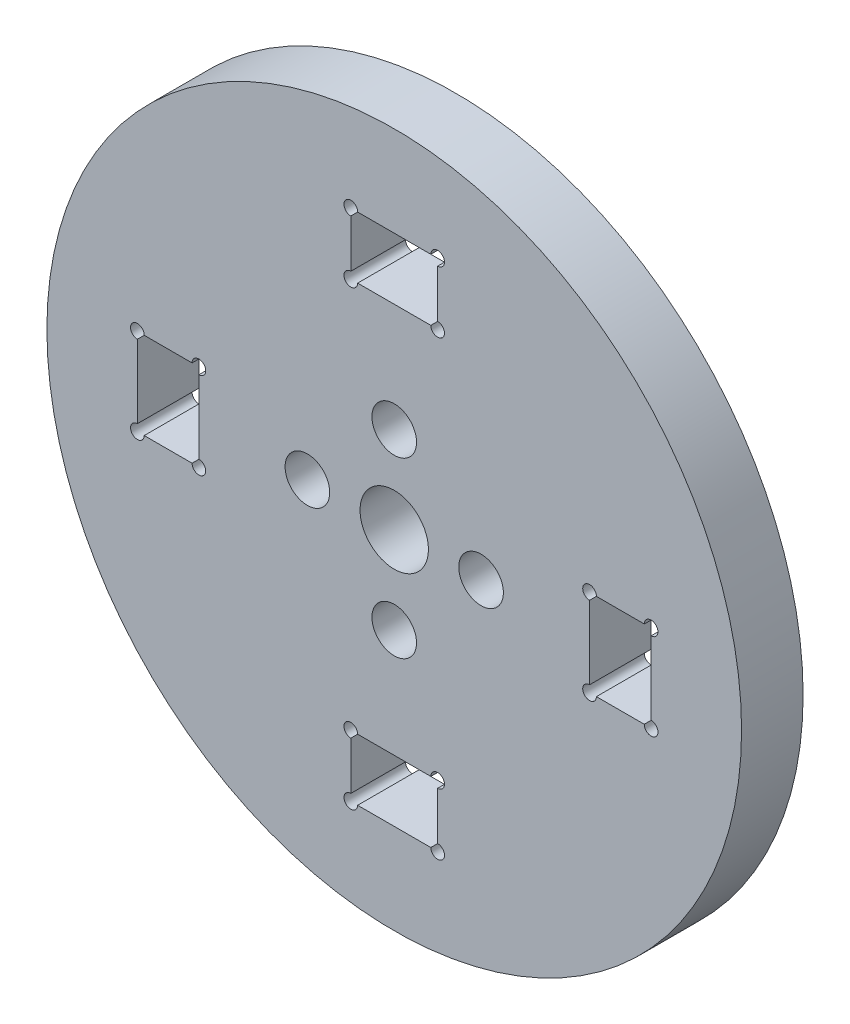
ISO-10303-21;
HEADER;
FILE_DESCRIPTION(('STEP AP214'),'2;1');
FILE_NAME('part.step','',(''),(''),'','','');
FILE_SCHEMA(('AUTOMOTIVE_DESIGN { 1 0 10303 214 1 1 1 1 }'));
ENDSEC;
DATA;
#1=APPLICATION_CONTEXT('core data for automotive mechanical design processes');
#2=APPLICATION_PROTOCOL_DEFINITION('international standard','automotive_design',2000,#1);
#3=PRODUCT_CONTEXT('',#1,'mechanical');
#4=PRODUCT('Part','Part','',(#3));
#5=PRODUCT_RELATED_PRODUCT_CATEGORY('part','',(#4));
#6=PRODUCT_DEFINITION_FORMATION('','',#4);
#7=PRODUCT_DEFINITION_CONTEXT('part definition',#1,'design');
#8=PRODUCT_DEFINITION('design','',#6,#7);
#9=PRODUCT_DEFINITION_SHAPE('','',#8);
#10=(LENGTH_UNIT() NAMED_UNIT(*) SI_UNIT(.MILLI.,.METRE.));
#11=(NAMED_UNIT(*) PLANE_ANGLE_UNIT() SI_UNIT($,.RADIAN.));
#12=(NAMED_UNIT(*) SI_UNIT($,.STERADIAN.) SOLID_ANGLE_UNIT());
#13=UNCERTAINTY_MEASURE_WITH_UNIT(LENGTH_MEASURE(1.E-05),#10,'distance_accuracy_value','');
#14=(GEOMETRIC_REPRESENTATION_CONTEXT(3) GLOBAL_UNCERTAINTY_ASSIGNED_CONTEXT((#13)) GLOBAL_UNIT_ASSIGNED_CONTEXT((#10,
#11,#12)) REPRESENTATION_CONTEXT('',''));
#15=CARTESIAN_POINT('',(0.,0.,0.));
#16=DIRECTION('',(0.,0.,1.));
#17=DIRECTION('',(1.,0.,0.));
#18=AXIS2_PLACEMENT_3D('',#15,#16,#17);
#19=CARTESIAN_POINT('',(0.,0.,4.5));
#20=DIRECTION('',(0.,0.,1.));
#21=DIRECTION('',(1.,0.,0.));
#22=AXIS2_PLACEMENT_3D('',#19,#20,#21);
#23=PLANE('',#22);
#24=CARTESIAN_POINT('',(0.,6.35,4.5));
#25=DIRECTION('',(0.,0.,1.));
#26=DIRECTION('',(1.,0.,0.));
#27=AXIS2_PLACEMENT_3D('',#24,#25,#26);
#28=CIRCLE('',#27,1.63195);
#29=CARTESIAN_POINT('',(1.63195,6.35,4.5));
#30=VERTEX_POINT('',#29);
#31=EDGE_CURVE('E526',#30,#30,#28,.T.);
#32=ORIENTED_EDGE('',*,*,#31,.F.);
#33=EDGE_LOOP('',(#32));
#34=FACE_BOUND('',#33,.T.);
#35=CARTESIAN_POINT('',(6.35000000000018,1.79700204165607E-13,4.5));
#36=DIRECTION('',(0.,0.,1.));
#37=DIRECTION('',(1.,0.,0.));
#38=AXIS2_PLACEMENT_3D('',#35,#36,#37);
#39=CIRCLE('',#38,1.63195);
#40=CARTESIAN_POINT('',(7.98195000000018,1.79700204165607E-13,4.5));
#41=VERTEX_POINT('',#40);
#42=EDGE_CURVE('E517',#41,#41,#39,.T.);
#43=ORIENTED_EDGE('',*,*,#42,.F.);
#44=EDGE_LOOP('',(#43));
#45=FACE_BOUND('',#44,.T.);
#46=CARTESIAN_POINT('',(3.59400408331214E-13,-6.35,4.5));
#47=DIRECTION('',(0.,0.,1.));
#48=DIRECTION('',(1.,0.,0.));
#49=AXIS2_PLACEMENT_3D('',#46,#47,#48);
#50=CIRCLE('',#49,1.63195);
#51=CARTESIAN_POINT('',(1.63195000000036,-6.35,4.5));
#52=VERTEX_POINT('',#51);
#53=EDGE_CURVE('E514',#52,#52,#50,.T.);
#54=ORIENTED_EDGE('',*,*,#53,.F.);
#55=EDGE_LOOP('',(#54));
#56=FACE_BOUND('',#55,.T.);
#57=CARTESIAN_POINT('',(-6.34999999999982,-1.78922553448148E-13,4.5));
#58=DIRECTION('',(0.,0.,1.));
#59=DIRECTION('',(1.,0.,0.));
#60=AXIS2_PLACEMENT_3D('',#57,#58,#59);
#61=CIRCLE('',#60,1.63195);
#62=CARTESIAN_POINT('',(-4.71804999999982,-1.78922553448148E-13,4.5));
#63=VERTEX_POINT('',#62);
#64=EDGE_CURVE('E268',#63,#63,#61,.T.);
#65=ORIENTED_EDGE('',*,*,#64,.F.);
#66=EDGE_LOOP('',(#65));
#67=FACE_BOUND('',#66,.T.);
#68=CARTESIAN_POINT('',(-18.7835533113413,3.17500000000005,4.5));
#69=DIRECTION('',(0.,0.,1.));
#70=DIRECTION('',(1.,0.,0.));
#71=AXIS2_PLACEMENT_3D('',#68,#69,#70);
#72=CIRCLE('',#71,0.5);
#73=CARTESIAN_POINT('',(-18.7835533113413,2.67500000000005,4.5));
#74=VERTEX_POINT('',#73);
#75=CARTESIAN_POINT('',(-18.2835533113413,3.17500000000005,4.5));
#76=VERTEX_POINT('',#75);
#77=EDGE_CURVE('E285',#74,#76,#72,.F.);
#78=ORIENTED_EDGE('',*,*,#77,.T.);
#79=DIRECTION('',(1.,0.,0.));
#80=VECTOR('',#79,1.);
#81=CARTESIAN_POINT('',(0.,3.175,4.5));
#82=LINE('',#81,#80);
#83=CARTESIAN_POINT('',(-14.7835533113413,3.17500000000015,4.5));
#84=VERTEX_POINT('',#83);
#85=EDGE_CURVE('E50',#76,#84,#82,.T.);
#86=ORIENTED_EDGE('',*,*,#85,.T.);
#87=CARTESIAN_POINT('',(-14.2835533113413,3.17500000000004,4.5));
#88=DIRECTION('',(0.,0.,1.));
#89=DIRECTION('',(1.,0.,0.));
#90=AXIS2_PLACEMENT_3D('',#87,#88,#89);
#91=CIRCLE('',#90,0.5);
#92=CARTESIAN_POINT('',(-14.2835533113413,2.67500000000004,4.5));
#93=VERTEX_POINT('',#92);
#94=EDGE_CURVE('E262',#84,#93,#91,.F.);
#95=ORIENTED_EDGE('',*,*,#94,.T.);
#96=DIRECTION('',(0.,1.,0.));
#97=VECTOR('',#96,1.);
#98=CARTESIAN_POINT('',(-14.2835533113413,1.4827788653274E-13,4.5));
#99=LINE('',#98,#97);
#100=CARTESIAN_POINT('',(-14.2835533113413,-2.67499999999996,4.5));
#101=VERTEX_POINT('',#100);
#102=EDGE_CURVE('E265',#101,#93,#99,.T.);
#103=ORIENTED_EDGE('',*,*,#102,.F.);
#104=CARTESIAN_POINT('',(-14.2835533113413,-3.17499999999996,4.5));
#105=DIRECTION('',(0.,0.,1.));
#106=DIRECTION('',(1.,0.,0.));
#107=AXIS2_PLACEMENT_3D('',#104,#105,#106);
#108=CIRCLE('',#107,0.5);
#109=CARTESIAN_POINT('',(-14.7835533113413,-3.17499999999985,4.5));
#110=VERTEX_POINT('',#109);
#111=EDGE_CURVE('E297',#110,#101,#108,.T.);
#112=ORIENTED_EDGE('',*,*,#111,.F.);
#113=DIRECTION('',(1.,0.,0.));
#114=VECTOR('',#113,1.);
#115=CARTESIAN_POINT('',(0.,-3.175,4.5));
#116=LINE('',#115,#114);
#117=CARTESIAN_POINT('',(-18.2835533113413,-3.17499999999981,4.5));
#118=VERTEX_POINT('',#117);
#119=EDGE_CURVE('E294',#118,#110,#116,.T.);
#120=ORIENTED_EDGE('',*,*,#119,.F.);
#121=CARTESIAN_POINT('',(-18.7835533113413,-3.17499999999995,4.5));
#122=DIRECTION('',(0.,0.,1.));
#123=DIRECTION('',(1.,0.,0.));
#124=AXIS2_PLACEMENT_3D('',#121,#122,#123);
#125=CIRCLE('',#124,0.5);
#126=CARTESIAN_POINT('',(-18.7835533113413,-2.67499999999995,4.5));
#127=VERTEX_POINT('',#126);
#128=EDGE_CURVE('E291',#127,#118,#125,.T.);
#129=ORIENTED_EDGE('',*,*,#128,.F.);
#130=DIRECTION('',(0.,1.,0.));
#131=VECTOR('',#130,1.);
#132=CARTESIAN_POINT('',(-18.7835533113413,2.05255249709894E-13,4.5));
#133=LINE('',#132,#131);
#134=EDGE_CURVE('E288',#127,#74,#133,.T.);
#135=ORIENTED_EDGE('',*,*,#134,.T.);
#136=EDGE_LOOP('',(#78,#86,#95,#103,#112,#120,#129,#135));
#137=FACE_BOUND('',#136,.T.);
#138=CARTESIAN_POINT('',(18.7835533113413,-3.17500000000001,4.5));
#139=DIRECTION('',(0.,0.,1.));
#140=DIRECTION('',(1.,0.,0.));
#141=AXIS2_PLACEMENT_3D('',#138,#139,#140);
#142=CIRCLE('',#141,0.5);
#143=CARTESIAN_POINT('',(18.7835533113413,-2.67500000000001,4.5));
#144=VERTEX_POINT('',#143);
#145=CARTESIAN_POINT('',(18.2835533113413,-3.17500000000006,4.5));
#146=VERTEX_POINT('',#145);
#147=EDGE_CURVE('E403',#144,#146,#142,.F.);
#148=ORIENTED_EDGE('',*,*,#147,.T.);
#149=DIRECTION('',(-1.,0.,0.));
#150=VECTOR('',#149,1.);
#151=CARTESIAN_POINT('',(0.,-3.175,4.5));
#152=LINE('',#151,#150);
#153=CARTESIAN_POINT('',(14.7835533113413,-3.17500000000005,4.5));
#154=VERTEX_POINT('',#153);
#155=EDGE_CURVE('E363',#146,#154,#152,.T.);
#156=ORIENTED_EDGE('',*,*,#155,.T.);
#157=CARTESIAN_POINT('',(14.2835533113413,-3.17500000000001,4.5));
#158=DIRECTION('',(0.,0.,1.));
#159=DIRECTION('',(1.,0.,0.));
#160=AXIS2_PLACEMENT_3D('',#157,#158,#159);
#161=CIRCLE('',#160,0.5);
#162=CARTESIAN_POINT('',(14.2835533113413,-2.67500000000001,4.5));
#163=VERTEX_POINT('',#162);
#164=EDGE_CURVE('E381',#154,#163,#161,.F.);
#165=ORIENTED_EDGE('',*,*,#164,.T.);
#166=DIRECTION('',(0.,-1.,0.));
#167=VECTOR('',#166,1.);
#168=CARTESIAN_POINT('',(14.2835533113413,0.,4.5));
#169=LINE('',#168,#167);
#170=CARTESIAN_POINT('',(14.2835533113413,2.67499999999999,4.5));
#171=VERTEX_POINT('',#170);
#172=EDGE_CURVE('E418',#171,#163,#169,.T.);
#173=ORIENTED_EDGE('',*,*,#172,.F.);
#174=CARTESIAN_POINT('',(14.2835533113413,3.17499999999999,4.5));
#175=DIRECTION('',(0.,0.,1.));
#176=DIRECTION('',(1.,0.,0.));
#177=AXIS2_PLACEMENT_3D('',#174,#175,#176);
#178=CIRCLE('',#177,0.5);
#179=CARTESIAN_POINT('',(14.7835533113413,3.17499999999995,4.5));
#180=VERTEX_POINT('',#179);
#181=EDGE_CURVE('E415',#180,#171,#178,.T.);
#182=ORIENTED_EDGE('',*,*,#181,.F.);
#183=DIRECTION('',(-1.,0.,0.));
#184=VECTOR('',#183,1.);
#185=CARTESIAN_POINT('',(0.,3.175,4.5));
#186=LINE('',#185,#184);
#187=CARTESIAN_POINT('',(18.2835533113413,3.17499999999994,4.5));
#188=VERTEX_POINT('',#187);
#189=EDGE_CURVE('E412',#188,#180,#186,.T.);
#190=ORIENTED_EDGE('',*,*,#189,.F.);
#191=CARTESIAN_POINT('',(18.7835533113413,3.17499999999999,4.5));
#192=DIRECTION('',(0.,0.,1.));
#193=DIRECTION('',(1.,0.,0.));
#194=AXIS2_PLACEMENT_3D('',#191,#192,#193);
#195=CIRCLE('',#194,0.5);
#196=CARTESIAN_POINT('',(18.7835533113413,2.67499999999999,4.5));
#197=VERTEX_POINT('',#196);
#198=EDGE_CURVE('E409',#197,#188,#195,.T.);
#199=ORIENTED_EDGE('',*,*,#198,.F.);
#200=DIRECTION('',(0.,-1.,0.));
#201=VECTOR('',#200,1.);
#202=CARTESIAN_POINT('',(18.7835533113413,0.,4.5));
#203=LINE('',#202,#201);
#204=EDGE_CURVE('E406',#197,#144,#203,.T.);
#205=ORIENTED_EDGE('',*,*,#204,.T.);
#206=EDGE_LOOP('',(#148,#156,#165,#173,#182,#190,#199,#205));
#207=FACE_BOUND('',#206,.T.);
#208=CARTESIAN_POINT('',(0.,0.,4.5));
#209=DIRECTION('',(0.,0.,1.));
#210=DIRECTION('',(1.,0.,0.));
#211=AXIS2_PLACEMENT_3D('',#208,#209,#210);
#212=CIRCLE('',#211,25.4);
#213=CARTESIAN_POINT('',(25.4,0.,4.5));
#214=VERTEX_POINT('',#213);
#215=EDGE_CURVE('E11',#214,#214,#212,.T.);
#216=ORIENTED_EDGE('',*,*,#215,.T.);
#217=EDGE_LOOP('',(#216));
#218=FACE_BOUND('',#217,.T.);
#219=CARTESIAN_POINT('',(0.,0.,4.5));
#220=DIRECTION('',(0.,0.,1.));
#221=DIRECTION('',(1.,0.,0.));
#222=AXIS2_PLACEMENT_3D('',#219,#220,#221);
#223=CIRCLE('',#222,2.5);
#224=CARTESIAN_POINT('',(2.5,0.,4.5));
#225=VERTEX_POINT('',#224);
#226=EDGE_CURVE('E503',#225,#225,#223,.T.);
#227=ORIENTED_EDGE('',*,*,#226,.F.);
#228=EDGE_LOOP('',(#227));
#229=FACE_BOUND('',#228,.T.);
#230=DIRECTION('',(1.,0.,0.));
#231=VECTOR('',#230,1.);
#232=CARTESIAN_POINT('',(0.,18.7835533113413,4.5));
#233=LINE('',#232,#231);
#234=CARTESIAN_POINT('',(-2.675,18.7835533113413,4.5));
#235=VERTEX_POINT('',#234);
#236=CARTESIAN_POINT('',(2.675,18.7835533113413,4.5));
#237=VERTEX_POINT('',#236);
#238=EDGE_CURVE('E465',#235,#237,#233,.T.);
#239=ORIENTED_EDGE('',*,*,#238,.T.);
#240=CARTESIAN_POINT('',(3.175,18.7835533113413,4.5));
#241=DIRECTION('',(0.,0.,1.));
#242=DIRECTION('',(1.,0.,0.));
#243=AXIS2_PLACEMENT_3D('',#240,#241,#242);
#244=CIRCLE('',#243,0.5);
#245=CARTESIAN_POINT('',(3.175,18.2835533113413,4.5));
#246=VERTEX_POINT('',#245);
#247=EDGE_CURVE('E426',#237,#246,#244,.F.);
#248=ORIENTED_EDGE('',*,*,#247,.T.);
#249=DIRECTION('',(0.,-1.,0.));
#250=VECTOR('',#249,1.);
#251=CARTESIAN_POINT('',(3.175,0.,4.5));
#252=LINE('',#251,#250);
#253=CARTESIAN_POINT('',(3.175,14.7835533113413,4.5));
#254=VERTEX_POINT('',#253);
#255=EDGE_CURVE('E444',#246,#254,#252,.T.);
#256=ORIENTED_EDGE('',*,*,#255,.T.);
#257=CARTESIAN_POINT('',(3.175,14.2835533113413,4.5));
#258=DIRECTION('',(0.,0.,1.));
#259=DIRECTION('',(1.,0.,0.));
#260=AXIS2_PLACEMENT_3D('',#257,#258,#259);
#261=CIRCLE('',#260,0.5);
#262=CARTESIAN_POINT('',(2.675,14.2835533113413,4.5));
#263=VERTEX_POINT('',#262);
#264=EDGE_CURVE('E480',#254,#263,#261,.F.);
#265=ORIENTED_EDGE('',*,*,#264,.T.);
#266=DIRECTION('',(1.,0.,0.));
#267=VECTOR('',#266,1.);
#268=CARTESIAN_POINT('',(0.,14.2835533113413,4.5));
#269=LINE('',#268,#267);
#270=CARTESIAN_POINT('',(-2.675,14.2835533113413,4.5));
#271=VERTEX_POINT('',#270);
#272=EDGE_CURVE('E477',#271,#263,#269,.T.);
#273=ORIENTED_EDGE('',*,*,#272,.F.);
#274=CARTESIAN_POINT('',(-3.175,14.2835533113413,4.5));
#275=DIRECTION('',(0.,0.,1.));
#276=DIRECTION('',(1.,0.,0.));
#277=AXIS2_PLACEMENT_3D('',#274,#275,#276);
#278=CIRCLE('',#277,0.5);
#279=CARTESIAN_POINT('',(-3.175,14.7835533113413,4.5));
#280=VERTEX_POINT('',#279);
#281=EDGE_CURVE('E474',#280,#271,#278,.T.);
#282=ORIENTED_EDGE('',*,*,#281,.F.);
#283=DIRECTION('',(0.,-1.,0.));
#284=VECTOR('',#283,1.);
#285=CARTESIAN_POINT('',(-3.175,0.,4.5));
#286=LINE('',#285,#284);
#287=CARTESIAN_POINT('',(-3.175,18.2835533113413,4.5));
#288=VERTEX_POINT('',#287);
#289=EDGE_CURVE('E471',#288,#280,#286,.T.);
#290=ORIENTED_EDGE('',*,*,#289,.F.);
#291=CARTESIAN_POINT('',(-3.175,18.7835533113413,4.5));
#292=DIRECTION('',(0.,0.,1.));
#293=DIRECTION('',(1.,0.,0.));
#294=AXIS2_PLACEMENT_3D('',#291,#292,#293);
#295=CIRCLE('',#294,0.5);
#296=EDGE_CURVE('E468',#235,#288,#295,.T.);
#297=ORIENTED_EDGE('',*,*,#296,.F.);
#298=EDGE_LOOP('',(#239,#248,#256,#265,#273,#282,#290,#297));
#299=FACE_BOUND('',#298,.T.);
#300=DIRECTION('',(-1.,0.,0.));
#301=VECTOR('',#300,1.);
#302=CARTESIAN_POINT('',(-1.23153149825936E-13,-18.7835533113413,4.5));
#303=LINE('',#302,#301);
#304=CARTESIAN_POINT('',(2.67499999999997,-18.7835533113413,4.5));
#305=VERTEX_POINT('',#304);
#306=CARTESIAN_POINT('',(-2.67500000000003,-18.7835533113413,4.5));
#307=VERTEX_POINT('',#306);
#308=EDGE_CURVE('E340',#305,#307,#303,.T.);
#309=ORIENTED_EDGE('',*,*,#308,.T.);
#310=CARTESIAN_POINT('',(-3.17500000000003,-18.7835533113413,4.5));
#311=DIRECTION('',(0.,0.,1.));
#312=DIRECTION('',(1.,0.,0.));
#313=AXIS2_PLACEMENT_3D('',#310,#311,#312);
#314=CIRCLE('',#313,0.5);
#315=CARTESIAN_POINT('',(-3.17500000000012,-18.2835533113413,4.5));
#316=VERTEX_POINT('',#315);
#317=EDGE_CURVE('E304',#307,#316,#314,.F.);
#318=ORIENTED_EDGE('',*,*,#317,.T.);
#319=DIRECTION('',(0.,1.,0.));
#320=VECTOR('',#319,1.);
#321=CARTESIAN_POINT('',(-3.175,0.,4.5));
#322=LINE('',#321,#320);
#323=CARTESIAN_POINT('',(-3.1750000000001,-14.7835533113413,4.5));
#324=VERTEX_POINT('',#323);
#325=EDGE_CURVE('E319',#316,#324,#322,.T.);
#326=ORIENTED_EDGE('',*,*,#325,.T.);
#327=CARTESIAN_POINT('',(-3.17500000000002,-14.2835533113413,4.5));
#328=DIRECTION('',(0.,0.,1.));
#329=DIRECTION('',(1.,0.,0.));
#330=AXIS2_PLACEMENT_3D('',#327,#328,#329);
#331=CIRCLE('',#330,0.5);
#332=CARTESIAN_POINT('',(-2.67500000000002,-14.2835533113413,4.5));
#333=VERTEX_POINT('',#332);
#334=EDGE_CURVE('E355',#324,#333,#331,.F.);
#335=ORIENTED_EDGE('',*,*,#334,.T.);
#336=DIRECTION('',(-1.,0.,0.));
#337=VECTOR('',#336,1.);
#338=CARTESIAN_POINT('',(-1.01453290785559E-13,-14.2835533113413,4.5));
#339=LINE('',#338,#337);
#340=CARTESIAN_POINT('',(2.67499999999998,-14.2835533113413,4.5));
#341=VERTEX_POINT('',#340);
#342=EDGE_CURVE('E352',#341,#333,#339,.T.);
#343=ORIENTED_EDGE('',*,*,#342,.F.);
#344=CARTESIAN_POINT('',(3.17499999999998,-14.2835533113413,4.5));
#345=DIRECTION('',(0.,0.,1.));
#346=DIRECTION('',(1.,0.,0.));
#347=AXIS2_PLACEMENT_3D('',#344,#345,#346);
#348=CIRCLE('',#347,0.5);
#349=CARTESIAN_POINT('',(3.1749999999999,-14.7835533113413,4.5));
#350=VERTEX_POINT('',#349);
#351=EDGE_CURVE('E349',#350,#341,#348,.T.);
#352=ORIENTED_EDGE('',*,*,#351,.F.);
#353=DIRECTION('',(0.,1.,0.));
#354=VECTOR('',#353,1.);
#355=CARTESIAN_POINT('',(3.175,0.,4.5));
#356=LINE('',#355,#354);
#357=CARTESIAN_POINT('',(3.17499999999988,-18.2835533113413,4.5));
#358=VERTEX_POINT('',#357);
#359=EDGE_CURVE('E346',#358,#350,#356,.T.);
#360=ORIENTED_EDGE('',*,*,#359,.F.);
#361=CARTESIAN_POINT('',(3.17499999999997,-18.7835533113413,4.5));
#362=DIRECTION('',(0.,0.,1.));
#363=DIRECTION('',(1.,0.,0.));
#364=AXIS2_PLACEMENT_3D('',#361,#362,#363);
#365=CIRCLE('',#364,0.5);
#366=EDGE_CURVE('E343',#305,#358,#365,.T.);
#367=ORIENTED_EDGE('',*,*,#366,.F.);
#368=EDGE_LOOP('',(#309,#318,#326,#335,#343,#352,#360,#367));
#369=FACE_BOUND('',#368,.T.);
#370=ADVANCED_FACE('F33',(#34,#45,#56,#67,#137,#207,#218,#229,#299,#369),#23,.T.);
#371=CARTESIAN_POINT('',(0.,0.,0.));
#372=DIRECTION('',(0.,0.,1.));
#373=DIRECTION('',(1.,0.,0.));
#374=AXIS2_PLACEMENT_3D('',#371,#372,#373);
#375=PLANE('',#374);
#376=CARTESIAN_POINT('',(0.,6.35,0.));
#377=DIRECTION('',(0.,0.,1.));
#378=DIRECTION('',(1.,0.,0.));
#379=AXIS2_PLACEMENT_3D('',#376,#377,#378);
#380=CIRCLE('',#379,1.63195);
#381=CARTESIAN_POINT('',(1.63195,6.35,0.));
#382=VERTEX_POINT('',#381);
#383=EDGE_CURVE('E37',#382,#382,#380,.T.);
#384=ORIENTED_EDGE('',*,*,#383,.T.);
#385=EDGE_LOOP('',(#384));
#386=FACE_BOUND('',#385,.T.);
#387=CARTESIAN_POINT('',(6.35000000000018,1.79700204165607E-13,0.));
#388=DIRECTION('',(0.,0.,1.));
#389=DIRECTION('',(1.,0.,0.));
#390=AXIS2_PLACEMENT_3D('',#387,#388,#389);
#391=CIRCLE('',#390,1.63195);
#392=CARTESIAN_POINT('',(7.98195000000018,1.79700204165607E-13,0.));
#393=VERTEX_POINT('',#392);
#394=EDGE_CURVE('E515',#393,#393,#391,.T.);
#395=ORIENTED_EDGE('',*,*,#394,.T.);
#396=EDGE_LOOP('',(#395));
#397=FACE_BOUND('',#396,.T.);
#398=CARTESIAN_POINT('',(3.59400408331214E-13,-6.35,0.));
#399=DIRECTION('',(0.,0.,1.));
#400=DIRECTION('',(1.,0.,0.));
#401=AXIS2_PLACEMENT_3D('',#398,#399,#400);
#402=CIRCLE('',#401,1.63195);
#403=CARTESIAN_POINT('',(1.63195000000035,-6.35,0.));
#404=VERTEX_POINT('',#403);
#405=EDGE_CURVE('E512',#404,#404,#402,.T.);
#406=ORIENTED_EDGE('',*,*,#405,.T.);
#407=EDGE_LOOP('',(#406));
#408=FACE_BOUND('',#407,.T.);
#409=CARTESIAN_POINT('',(-6.34999999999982,-1.78922553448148E-13,0.));
#410=DIRECTION('',(0.,0.,1.));
#411=DIRECTION('',(1.,0.,0.));
#412=AXIS2_PLACEMENT_3D('',#409,#410,#411);
#413=CIRCLE('',#412,1.63195);
#414=CARTESIAN_POINT('',(-4.71804999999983,-1.78922553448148E-13,0.));
#415=VERTEX_POINT('',#414);
#416=EDGE_CURVE('E286',#415,#415,#413,.T.);
#417=ORIENTED_EDGE('',*,*,#416,.T.);
#418=EDGE_LOOP('',(#417));
#419=FACE_BOUND('',#418,.T.);
#420=DIRECTION('',(1.,0.,0.));
#421=VECTOR('',#420,1.);
#422=CARTESIAN_POINT('',(0.,3.175,0.));
#423=LINE('',#422,#421);
#424=CARTESIAN_POINT('',(-18.2835533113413,3.17500000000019,0.));
#425=VERTEX_POINT('',#424);
#426=CARTESIAN_POINT('',(-14.7835533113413,3.17500000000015,0.));
#427=VERTEX_POINT('',#426);
#428=EDGE_CURVE('E252',#425,#427,#423,.T.);
#429=ORIENTED_EDGE('',*,*,#428,.F.);
#430=CARTESIAN_POINT('',(-18.7835533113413,3.17500000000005,0.));
#431=DIRECTION('',(0.,0.,1.));
#432=DIRECTION('',(1.,0.,0.));
#433=AXIS2_PLACEMENT_3D('',#430,#431,#432);
#434=CIRCLE('',#433,0.5);
#435=CARTESIAN_POINT('',(-18.7835533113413,2.67500000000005,0.));
#436=VERTEX_POINT('',#435);
#437=EDGE_CURVE('E244',#436,#425,#434,.F.);
#438=ORIENTED_EDGE('',*,*,#437,.F.);
#439=DIRECTION('',(0.,1.,0.));
#440=VECTOR('',#439,1.);
#441=CARTESIAN_POINT('',(-18.7835533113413,2.05255249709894E-13,0.));
#442=LINE('',#441,#440);
#443=CARTESIAN_POINT('',(-18.7835533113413,-2.67499999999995,0.));
#444=VERTEX_POINT('',#443);
#445=EDGE_CURVE('E251',#444,#436,#442,.T.);
#446=ORIENTED_EDGE('',*,*,#445,.F.);
#447=CARTESIAN_POINT('',(-18.7835533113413,-3.17499999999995,0.));
#448=DIRECTION('',(0.,0.,1.));
#449=DIRECTION('',(1.,0.,0.));
#450=AXIS2_PLACEMENT_3D('',#447,#448,#449);
#451=CIRCLE('',#450,0.5);
#452=CARTESIAN_POINT('',(-18.2835533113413,-3.17499999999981,0.));
#453=VERTEX_POINT('',#452);
#454=EDGE_CURVE('E272',#444,#453,#451,.T.);
#455=ORIENTED_EDGE('',*,*,#454,.T.);
#456=DIRECTION('',(1.,0.,0.));
#457=VECTOR('',#456,1.);
#458=CARTESIAN_POINT('',(0.,-3.175,0.));
#459=LINE('',#458,#457);
#460=CARTESIAN_POINT('',(-14.7835533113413,-3.17499999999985,0.));
#461=VERTEX_POINT('',#460);
#462=EDGE_CURVE('E275',#453,#461,#459,.T.);
#463=ORIENTED_EDGE('',*,*,#462,.T.);
#464=CARTESIAN_POINT('',(-14.2835533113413,-3.17499999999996,0.));
#465=DIRECTION('',(0.,0.,1.));
#466=DIRECTION('',(1.,0.,0.));
#467=AXIS2_PLACEMENT_3D('',#464,#465,#466);
#468=CIRCLE('',#467,0.5);
#469=CARTESIAN_POINT('',(-14.2835533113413,-2.67499999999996,0.));
#470=VERTEX_POINT('',#469);
#471=EDGE_CURVE('E278',#461,#470,#468,.T.);
#472=ORIENTED_EDGE('',*,*,#471,.T.);
#473=DIRECTION('',(0.,1.,0.));
#474=VECTOR('',#473,1.);
#475=CARTESIAN_POINT('',(-14.2835533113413,1.4827788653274E-13,0.));
#476=LINE('',#475,#474);
#477=CARTESIAN_POINT('',(-14.2835533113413,2.67500000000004,0.));
#478=VERTEX_POINT('',#477);
#479=EDGE_CURVE('E281',#470,#478,#476,.T.);
#480=ORIENTED_EDGE('',*,*,#479,.T.);
#481=CARTESIAN_POINT('',(-14.2835533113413,3.17500000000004,0.));
#482=DIRECTION('',(0.,0.,1.));
#483=DIRECTION('',(1.,0.,0.));
#484=AXIS2_PLACEMENT_3D('',#481,#482,#483);
#485=CIRCLE('',#484,0.5);
#486=EDGE_CURVE('E256',#427,#478,#485,.F.);
#487=ORIENTED_EDGE('',*,*,#486,.F.);
#488=EDGE_LOOP('',(#429,#438,#446,#455,#463,#472,#480,#487));
#489=FACE_BOUND('',#488,.T.);
#490=CARTESIAN_POINT('',(3.175,18.7835533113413,0.));
#491=DIRECTION('',(0.,0.,1.));
#492=DIRECTION('',(1.,0.,0.));
#493=AXIS2_PLACEMENT_3D('',#490,#491,#492);
#494=CIRCLE('',#493,0.5);
#495=CARTESIAN_POINT('',(2.675,18.7835533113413,0.));
#496=VERTEX_POINT('',#495);
#497=CARTESIAN_POINT('',(3.175,18.2835533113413,0.));
#498=VERTEX_POINT('',#497);
#499=EDGE_CURVE('E441',#496,#498,#494,.F.);
#500=ORIENTED_EDGE('',*,*,#499,.F.);
#501=DIRECTION('',(1.,0.,0.));
#502=VECTOR('',#501,1.);
#503=CARTESIAN_POINT('',(0.,18.7835533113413,0.));
#504=LINE('',#503,#502);
#505=CARTESIAN_POINT('',(-2.675,18.7835533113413,0.));
#506=VERTEX_POINT('',#505);
#507=EDGE_CURVE('E443',#506,#496,#504,.T.);
#508=ORIENTED_EDGE('',*,*,#507,.F.);
#509=CARTESIAN_POINT('',(-3.175,18.7835533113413,0.));
#510=DIRECTION('',(0.,0.,1.));
#511=DIRECTION('',(1.,0.,0.));
#512=AXIS2_PLACEMENT_3D('',#509,#510,#511);
#513=CIRCLE('',#512,0.5);
#514=CARTESIAN_POINT('',(-3.175,18.2835533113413,0.));
#515=VERTEX_POINT('',#514);
#516=EDGE_CURVE('E446',#506,#515,#513,.T.);
#517=ORIENTED_EDGE('',*,*,#516,.T.);
#518=DIRECTION('',(0.,-1.,0.));
#519=VECTOR('',#518,1.);
#520=CARTESIAN_POINT('',(-3.175,0.,0.));
#521=LINE('',#520,#519);
#522=CARTESIAN_POINT('',(-3.175,14.7835533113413,0.));
#523=VERTEX_POINT('',#522);
#524=EDGE_CURVE('E449',#515,#523,#521,.T.);
#525=ORIENTED_EDGE('',*,*,#524,.T.);
#526=CARTESIAN_POINT('',(-3.175,14.2835533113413,0.));
#527=DIRECTION('',(0.,0.,1.));
#528=DIRECTION('',(1.,0.,0.));
#529=AXIS2_PLACEMENT_3D('',#526,#527,#528);
#530=CIRCLE('',#529,0.5);
#531=CARTESIAN_POINT('',(-2.675,14.2835533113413,0.));
#532=VERTEX_POINT('',#531);
#533=EDGE_CURVE('E452',#523,#532,#530,.T.);
#534=ORIENTED_EDGE('',*,*,#533,.T.);
#535=DIRECTION('',(1.,0.,0.));
#536=VECTOR('',#535,1.);
#537=CARTESIAN_POINT('',(0.,14.2835533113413,0.));
#538=LINE('',#537,#536);
#539=CARTESIAN_POINT('',(2.675,14.2835533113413,0.));
#540=VERTEX_POINT('',#539);
#541=EDGE_CURVE('E455',#532,#540,#538,.T.);
#542=ORIENTED_EDGE('',*,*,#541,.T.);
#543=CARTESIAN_POINT('',(3.175,14.2835533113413,0.));
#544=DIRECTION('',(0.,0.,1.));
#545=DIRECTION('',(1.,0.,0.));
#546=AXIS2_PLACEMENT_3D('',#543,#544,#545);
#547=CIRCLE('',#546,0.5);
#548=CARTESIAN_POINT('',(3.175,14.7835533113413,0.));
#549=VERTEX_POINT('',#548);
#550=EDGE_CURVE('E458',#549,#540,#547,.F.);
#551=ORIENTED_EDGE('',*,*,#550,.F.);
#552=DIRECTION('',(0.,-1.,0.));
#553=VECTOR('',#552,1.);
#554=CARTESIAN_POINT('',(3.175,0.,0.));
#555=LINE('',#554,#553);
#556=EDGE_CURVE('E460',#498,#549,#555,.T.);
#557=ORIENTED_EDGE('',*,*,#556,.F.);
#558=EDGE_LOOP('',(#500,#508,#517,#525,#534,#542,#551,#557));
#559=FACE_BOUND('',#558,.T.);
#560=CARTESIAN_POINT('',(0.,0.,0.));
#561=DIRECTION('',(0.,0.,1.));
#562=DIRECTION('',(1.,0.,0.));
#563=AXIS2_PLACEMENT_3D('',#560,#561,#562);
#564=CIRCLE('',#563,25.4);
#565=CARTESIAN_POINT('',(25.4,0.,0.));
#566=VERTEX_POINT('',#565);
#567=EDGE_CURVE('E42',#566,#566,#564,.T.);
#568=ORIENTED_EDGE('',*,*,#567,.F.);
#569=EDGE_LOOP('',(#568));
#570=FACE_BOUND('',#569,.T.);
#571=CARTESIAN_POINT('',(0.,0.,0.));
#572=DIRECTION('',(0.,0.,1.));
#573=DIRECTION('',(1.,0.,0.));
#574=AXIS2_PLACEMENT_3D('',#571,#572,#573);
#575=CIRCLE('',#574,2.5);
#576=CARTESIAN_POINT('',(2.5,0.,0.));
#577=VERTEX_POINT('',#576);
#578=EDGE_CURVE('E488',#577,#577,#575,.T.);
#579=ORIENTED_EDGE('',*,*,#578,.T.);
#580=EDGE_LOOP('',(#579));
#581=FACE_BOUND('',#580,.T.);
#582=DIRECTION('',(-1.,0.,0.));
#583=VECTOR('',#582,1.);
#584=CARTESIAN_POINT('',(0.,-3.175,0.));
#585=LINE('',#584,#583);
#586=CARTESIAN_POINT('',(18.2835533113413,-3.17500000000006,0.));
#587=VERTEX_POINT('',#586);
#588=CARTESIAN_POINT('',(14.7835533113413,-3.17500000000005,0.));
#589=VERTEX_POINT('',#588);
#590=EDGE_CURVE('E378',#587,#589,#585,.T.);
#591=ORIENTED_EDGE('',*,*,#590,.F.);
#592=CARTESIAN_POINT('',(18.7835533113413,-3.17500000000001,0.));
#593=DIRECTION('',(0.,0.,1.));
#594=DIRECTION('',(1.,0.,0.));
#595=AXIS2_PLACEMENT_3D('',#592,#593,#594);
#596=CIRCLE('',#595,0.5);
#597=CARTESIAN_POINT('',(18.7835533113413,-2.67500000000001,0.));
#598=VERTEX_POINT('',#597);
#599=EDGE_CURVE('E380',#598,#587,#596,.F.);
#600=ORIENTED_EDGE('',*,*,#599,.F.);
#601=DIRECTION('',(0.,-1.,0.));
#602=VECTOR('',#601,1.);
#603=CARTESIAN_POINT('',(18.7835533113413,0.,0.));
#604=LINE('',#603,#602);
#605=CARTESIAN_POINT('',(18.7835533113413,2.67499999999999,0.));
#606=VERTEX_POINT('',#605);
#607=EDGE_CURVE('E383',#606,#598,#604,.T.);
#608=ORIENTED_EDGE('',*,*,#607,.F.);
#609=CARTESIAN_POINT('',(18.7835533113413,3.17499999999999,0.));
#610=DIRECTION('',(0.,0.,1.));
#611=DIRECTION('',(1.,0.,0.));
#612=AXIS2_PLACEMENT_3D('',#609,#610,#611);
#613=CIRCLE('',#612,0.5);
#614=CARTESIAN_POINT('',(18.2835533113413,3.17499999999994,0.));
#615=VERTEX_POINT('',#614);
#616=EDGE_CURVE('E386',#606,#615,#613,.T.);
#617=ORIENTED_EDGE('',*,*,#616,.T.);
#618=DIRECTION('',(-1.,0.,0.));
#619=VECTOR('',#618,1.);
#620=CARTESIAN_POINT('',(0.,3.175,0.));
#621=LINE('',#620,#619);
#622=CARTESIAN_POINT('',(14.7835533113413,3.17499999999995,0.));
#623=VERTEX_POINT('',#622);
#624=EDGE_CURVE('E389',#615,#623,#621,.T.);
#625=ORIENTED_EDGE('',*,*,#624,.T.);
#626=CARTESIAN_POINT('',(14.2835533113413,3.17499999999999,0.));
#627=DIRECTION('',(0.,0.,1.));
#628=DIRECTION('',(1.,0.,0.));
#629=AXIS2_PLACEMENT_3D('',#626,#627,#628);
#630=CIRCLE('',#629,0.5);
#631=CARTESIAN_POINT('',(14.2835533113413,2.67499999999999,0.));
#632=VERTEX_POINT('',#631);
#633=EDGE_CURVE('E392',#623,#632,#630,.T.);
#634=ORIENTED_EDGE('',*,*,#633,.T.);
#635=DIRECTION('',(0.,-1.,0.));
#636=VECTOR('',#635,1.);
#637=CARTESIAN_POINT('',(14.2835533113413,0.,0.));
#638=LINE('',#637,#636);
#639=CARTESIAN_POINT('',(14.2835533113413,-2.67500000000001,0.));
#640=VERTEX_POINT('',#639);
#641=EDGE_CURVE('E395',#632,#640,#638,.T.);
#642=ORIENTED_EDGE('',*,*,#641,.T.);
#643=CARTESIAN_POINT('',(14.2835533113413,-3.17500000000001,0.));
#644=DIRECTION('',(0.,0.,1.));
#645=DIRECTION('',(1.,0.,0.));
#646=AXIS2_PLACEMENT_3D('',#643,#644,#645);
#647=CIRCLE('',#646,0.5);
#648=EDGE_CURVE('E398',#589,#640,#647,.F.);
#649=ORIENTED_EDGE('',*,*,#648,.F.);
#650=EDGE_LOOP('',(#591,#600,#608,#617,#625,#634,#642,#649));
#651=FACE_BOUND('',#650,.T.);
#652=CARTESIAN_POINT('',(-3.17500000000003,-18.7835533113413,0.));
#653=DIRECTION('',(0.,0.,1.));
#654=DIRECTION('',(1.,0.,0.));
#655=AXIS2_PLACEMENT_3D('',#652,#653,#654);
#656=CIRCLE('',#655,0.5);
#657=CARTESIAN_POINT('',(-2.67500000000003,-18.7835533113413,0.));
#658=VERTEX_POINT('',#657);
#659=CARTESIAN_POINT('',(-3.17500000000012,-18.2835533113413,0.));
#660=VERTEX_POINT('',#659);
#661=EDGE_CURVE('E316',#658,#660,#656,.F.);
#662=ORIENTED_EDGE('',*,*,#661,.F.);
#663=DIRECTION('',(-1.,0.,0.));
#664=VECTOR('',#663,1.);
#665=CARTESIAN_POINT('',(-1.23153149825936E-13,-18.7835533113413,0.));
#666=LINE('',#665,#664);
#667=CARTESIAN_POINT('',(2.67499999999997,-18.7835533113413,0.));
#668=VERTEX_POINT('',#667);
#669=EDGE_CURVE('E318',#668,#658,#666,.T.);
#670=ORIENTED_EDGE('',*,*,#669,.F.);
#671=CARTESIAN_POINT('',(3.17499999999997,-18.7835533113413,0.));
#672=DIRECTION('',(0.,0.,1.));
#673=DIRECTION('',(1.,0.,0.));
#674=AXIS2_PLACEMENT_3D('',#671,#672,#673);
#675=CIRCLE('',#674,0.5);
#676=CARTESIAN_POINT('',(3.17499999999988,-18.2835533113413,0.));
#677=VERTEX_POINT('',#676);
#678=EDGE_CURVE('E321',#668,#677,#675,.T.);
#679=ORIENTED_EDGE('',*,*,#678,.T.);
#680=DIRECTION('',(0.,1.,0.));
#681=VECTOR('',#680,1.);
#682=CARTESIAN_POINT('',(3.175,0.,0.));
#683=LINE('',#682,#681);
#684=CARTESIAN_POINT('',(3.1749999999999,-14.7835533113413,0.));
#685=VERTEX_POINT('',#684);
#686=EDGE_CURVE('E324',#677,#685,#683,.T.);
#687=ORIENTED_EDGE('',*,*,#686,.T.);
#688=CARTESIAN_POINT('',(3.17499999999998,-14.2835533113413,0.));
#689=DIRECTION('',(0.,0.,1.));
#690=DIRECTION('',(1.,0.,0.));
#691=AXIS2_PLACEMENT_3D('',#688,#689,#690);
#692=CIRCLE('',#691,0.5);
#693=CARTESIAN_POINT('',(2.67499999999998,-14.2835533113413,0.));
#694=VERTEX_POINT('',#693);
#695=EDGE_CURVE('E327',#685,#694,#692,.T.);
#696=ORIENTED_EDGE('',*,*,#695,.T.);
#697=DIRECTION('',(-1.,0.,0.));
#698=VECTOR('',#697,1.);
#699=CARTESIAN_POINT('',(-1.01453290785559E-13,-14.2835533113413,0.));
#700=LINE('',#699,#698);
#701=CARTESIAN_POINT('',(-2.67500000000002,-14.2835533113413,0.));
#702=VERTEX_POINT('',#701);
#703=EDGE_CURVE('E330',#694,#702,#700,.T.);
#704=ORIENTED_EDGE('',*,*,#703,.T.);
#705=CARTESIAN_POINT('',(-3.17500000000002,-14.2835533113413,0.));
#706=DIRECTION('',(0.,0.,1.));
#707=DIRECTION('',(1.,0.,0.));
#708=AXIS2_PLACEMENT_3D('',#705,#706,#707);
#709=CIRCLE('',#708,0.5);
#710=CARTESIAN_POINT('',(-3.1750000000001,-14.7835533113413,0.));
#711=VERTEX_POINT('',#710);
#712=EDGE_CURVE('E333',#711,#702,#709,.F.);
#713=ORIENTED_EDGE('',*,*,#712,.F.);
#714=DIRECTION('',(0.,1.,0.));
#715=VECTOR('',#714,1.);
#716=CARTESIAN_POINT('',(-3.175,0.,0.));
#717=LINE('',#716,#715);
#718=EDGE_CURVE('E335',#660,#711,#717,.T.);
#719=ORIENTED_EDGE('',*,*,#718,.F.);
#720=EDGE_LOOP('',(#662,#670,#679,#687,#696,#704,#713,#719));
#721=FACE_BOUND('',#720,.T.);
#722=ADVANCED_FACE('F259',(#386,#397,#408,#419,#489,#559,#570,#581,#651,#721),#375,.F.);
#723=CARTESIAN_POINT('',(0.,0.,4.5));
#724=DIRECTION('',(0.,0.,-1.));
#725=DIRECTION('',(-1.,0.,0.));
#726=AXIS2_PLACEMENT_3D('',#723,#724,#725);
#727=CYLINDRICAL_SURFACE('',#726,25.4);
#728=ORIENTED_EDGE('',*,*,#215,.F.);
#729=EDGE_LOOP('',(#728));
#730=FACE_BOUND('',#729,.T.);
#731=ORIENTED_EDGE('',*,*,#567,.T.);
#732=EDGE_LOOP('',(#731));
#733=FACE_BOUND('',#732,.T.);
#734=ADVANCED_FACE('F35',(#730,#733),#727,.T.);
#735=CARTESIAN_POINT('',(0.,0.,4.5));
#736=DIRECTION('',(0.,0.,-1.));
#737=DIRECTION('',(-1.,0.,0.));
#738=AXIS2_PLACEMENT_3D('',#735,#736,#737);
#739=CYLINDRICAL_SURFACE('',#738,2.5);
#740=ORIENTED_EDGE('',*,*,#226,.T.);
#741=EDGE_LOOP('',(#740));
#742=FACE_BOUND('',#741,.T.);
#743=ORIENTED_EDGE('',*,*,#578,.F.);
#744=EDGE_LOOP('',(#743));
#745=FACE_BOUND('',#744,.T.);
#746=ADVANCED_FACE('F663',(#742,#745),#739,.F.);
#747=CARTESIAN_POINT('',(3.175,18.7835533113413,0.));
#748=DIRECTION('',(0.,0.,1.));
#749=DIRECTION('',(1.,0.,0.));
#750=AXIS2_PLACEMENT_3D('',#747,#748,#749);
#751=CYLINDRICAL_SURFACE('',#750,0.5);
#752=ORIENTED_EDGE('',*,*,#247,.F.);
#753=DIRECTION('',(0.,0.,1.));
#754=VECTOR('',#753,1.);
#755=CARTESIAN_POINT('',(2.675,18.7835533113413,0.));
#756=LINE('',#755,#754);
#757=EDGE_CURVE('E462',#496,#237,#756,.T.);
#758=ORIENTED_EDGE('',*,*,#757,.F.);
#759=ORIENTED_EDGE('',*,*,#499,.T.);
#760=DIRECTION('',(0.,0.,1.));
#761=VECTOR('',#760,1.);
#762=CARTESIAN_POINT('',(3.175,18.2835533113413,0.));
#763=LINE('',#762,#761);
#764=EDGE_CURVE('E485',#498,#246,#763,.T.);
#765=ORIENTED_EDGE('',*,*,#764,.T.);
#766=EDGE_LOOP('',(#752,#758,#759,#765));
#767=FACE_BOUND('',#766,.T.);
#768=ADVANCED_FACE('F637',(#767),#751,.F.);
#769=CARTESIAN_POINT('',(3.175,0.,0.));
#770=DIRECTION('',(-1.,0.,0.));
#771=DIRECTION('',(0.,-1.,0.));
#772=AXIS2_PLACEMENT_3D('',#769,#770,#771);
#773=PLANE('',#772);
#774=ORIENTED_EDGE('',*,*,#255,.F.);
#775=ORIENTED_EDGE('',*,*,#764,.F.);
#776=ORIENTED_EDGE('',*,*,#556,.T.);
#777=DIRECTION('',(0.,0.,1.));
#778=VECTOR('',#777,1.);
#779=CARTESIAN_POINT('',(3.175,14.7835533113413,0.));
#780=LINE('',#779,#778);
#781=EDGE_CURVE('E489',#549,#254,#780,.T.);
#782=ORIENTED_EDGE('',*,*,#781,.T.);
#783=EDGE_LOOP('',(#774,#775,#776,#782));
#784=FACE_BOUND('',#783,.T.);
#785=ADVANCED_FACE('F633',(#784),#773,.T.);
#786=CARTESIAN_POINT('',(3.175,14.2835533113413,0.));
#787=DIRECTION('',(0.,0.,1.));
#788=DIRECTION('',(1.,0.,0.));
#789=AXIS2_PLACEMENT_3D('',#786,#787,#788);
#790=CYLINDRICAL_SURFACE('',#789,0.5);
#791=ORIENTED_EDGE('',*,*,#264,.F.);
#792=ORIENTED_EDGE('',*,*,#781,.F.);
#793=ORIENTED_EDGE('',*,*,#550,.T.);
#794=DIRECTION('',(0.,0.,1.));
#795=VECTOR('',#794,1.);
#796=CARTESIAN_POINT('',(2.675,14.2835533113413,0.));
#797=LINE('',#796,#795);
#798=EDGE_CURVE('E491',#540,#263,#797,.T.);
#799=ORIENTED_EDGE('',*,*,#798,.T.);
#800=EDGE_LOOP('',(#791,#792,#793,#799));
#801=FACE_BOUND('',#800,.T.);
#802=ADVANCED_FACE('F636',(#801),#790,.F.);
#803=CARTESIAN_POINT('',(0.,14.2835533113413,0.));
#804=DIRECTION('',(0.,-1.,0.));
#805=DIRECTION('',(0.,0.,-1.));
#806=AXIS2_PLACEMENT_3D('',#803,#804,#805);
#807=PLANE('',#806);
#808=ORIENTED_EDGE('',*,*,#272,.T.);
#809=ORIENTED_EDGE('',*,*,#798,.F.);
#810=ORIENTED_EDGE('',*,*,#541,.F.);
#811=DIRECTION('',(0.,0.,1.));
#812=VECTOR('',#811,1.);
#813=CARTESIAN_POINT('',(-2.675,14.2835533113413,0.));
#814=LINE('',#813,#812);
#815=EDGE_CURVE('E493',#532,#271,#814,.T.);
#816=ORIENTED_EDGE('',*,*,#815,.T.);
#817=EDGE_LOOP('',(#808,#809,#810,#816));
#818=FACE_BOUND('',#817,.T.);
#819=ADVANCED_FACE('F641',(#818),#807,.F.);
#820=CARTESIAN_POINT('',(-3.175,14.2835533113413,0.));
#821=DIRECTION('',(0.,0.,1.));
#822=DIRECTION('',(1.,0.,0.));
#823=AXIS2_PLACEMENT_3D('',#820,#821,#822);
#824=CYLINDRICAL_SURFACE('',#823,0.5);
#825=ORIENTED_EDGE('',*,*,#281,.T.);
#826=ORIENTED_EDGE('',*,*,#815,.F.);
#827=ORIENTED_EDGE('',*,*,#533,.F.);
#828=DIRECTION('',(0.,0.,1.));
#829=VECTOR('',#828,1.);
#830=CARTESIAN_POINT('',(-3.175,14.7835533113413,0.));
#831=LINE('',#830,#829);
#832=EDGE_CURVE('E495',#523,#280,#831,.T.);
#833=ORIENTED_EDGE('',*,*,#832,.T.);
#834=EDGE_LOOP('',(#825,#826,#827,#833));
#835=FACE_BOUND('',#834,.T.);
#836=ADVANCED_FACE('F645',(#835),#824,.F.);
#837=CARTESIAN_POINT('',(-3.175,0.,0.));
#838=DIRECTION('',(-1.,0.,0.));
#839=DIRECTION('',(0.,-1.,0.));
#840=AXIS2_PLACEMENT_3D('',#837,#838,#839);
#841=PLANE('',#840);
#842=ORIENTED_EDGE('',*,*,#289,.T.);
#843=ORIENTED_EDGE('',*,*,#832,.F.);
#844=ORIENTED_EDGE('',*,*,#524,.F.);
#845=DIRECTION('',(0.,0.,1.));
#846=VECTOR('',#845,1.);
#847=CARTESIAN_POINT('',(-3.175,18.2835533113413,0.));
#848=LINE('',#847,#846);
#849=EDGE_CURVE('E497',#515,#288,#848,.T.);
#850=ORIENTED_EDGE('',*,*,#849,.T.);
#851=EDGE_LOOP('',(#842,#843,#844,#850));
#852=FACE_BOUND('',#851,.T.);
#853=ADVANCED_FACE('F649',(#852),#841,.F.);
#854=CARTESIAN_POINT('',(-3.175,18.7835533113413,0.));
#855=DIRECTION('',(0.,0.,1.));
#856=DIRECTION('',(1.,0.,0.));
#857=AXIS2_PLACEMENT_3D('',#854,#855,#856);
#858=CYLINDRICAL_SURFACE('',#857,0.5);
#859=ORIENTED_EDGE('',*,*,#296,.T.);
#860=ORIENTED_EDGE('',*,*,#849,.F.);
#861=ORIENTED_EDGE('',*,*,#516,.F.);
#862=DIRECTION('',(0.,0.,1.));
#863=VECTOR('',#862,1.);
#864=CARTESIAN_POINT('',(-2.675,18.7835533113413,0.));
#865=LINE('',#864,#863);
#866=EDGE_CURVE('E499',#506,#235,#865,.T.);
#867=ORIENTED_EDGE('',*,*,#866,.T.);
#868=EDGE_LOOP('',(#859,#860,#861,#867));
#869=FACE_BOUND('',#868,.T.);
#870=ADVANCED_FACE('F653',(#869),#858,.F.);
#871=CARTESIAN_POINT('',(0.,18.7835533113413,0.));
#872=DIRECTION('',(0.,-1.,0.));
#873=DIRECTION('',(0.,0.,-1.));
#874=AXIS2_PLACEMENT_3D('',#871,#872,#873);
#875=PLANE('',#874);
#876=ORIENTED_EDGE('',*,*,#238,.F.);
#877=ORIENTED_EDGE('',*,*,#866,.F.);
#878=ORIENTED_EDGE('',*,*,#507,.T.);
#879=ORIENTED_EDGE('',*,*,#757,.T.);
#880=EDGE_LOOP('',(#876,#877,#878,#879));
#881=FACE_BOUND('',#880,.T.);
#882=ADVANCED_FACE('F631',(#881),#875,.T.);
#883=CARTESIAN_POINT('',(0.,-3.175,0.));
#884=DIRECTION('',(0.,1.,0.));
#885=DIRECTION('',(-1.,0.,0.));
#886=AXIS2_PLACEMENT_3D('',#883,#884,#885);
#887=PLANE('',#886);
#888=ORIENTED_EDGE('',*,*,#155,.F.);
#889=DIRECTION('',(0.,0.,1.));
#890=VECTOR('',#889,1.);
#891=CARTESIAN_POINT('',(18.2835533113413,-3.17500000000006,0.));
#892=LINE('',#891,#890);
#893=EDGE_CURVE('E400',#587,#146,#892,.T.);
#894=ORIENTED_EDGE('',*,*,#893,.F.);
#895=ORIENTED_EDGE('',*,*,#590,.T.);
#896=DIRECTION('',(0.,0.,1.));
#897=VECTOR('',#896,1.);
#898=CARTESIAN_POINT('',(14.7835533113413,-3.17500000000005,0.));
#899=LINE('',#898,#897);
#900=EDGE_CURVE('E423',#589,#154,#899,.T.);
#901=ORIENTED_EDGE('',*,*,#900,.T.);
#902=EDGE_LOOP('',(#888,#894,#895,#901));
#903=FACE_BOUND('',#902,.T.);
#904=ADVANCED_FACE('F605',(#903),#887,.T.);
#905=CARTESIAN_POINT('',(14.2835533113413,-3.17500000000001,0.));
#906=DIRECTION('',(0.,0.,1.));
#907=DIRECTION('',(1.,0.,0.));
#908=AXIS2_PLACEMENT_3D('',#905,#906,#907);
#909=CYLINDRICAL_SURFACE('',#908,0.5);
#910=ORIENTED_EDGE('',*,*,#164,.F.);
#911=ORIENTED_EDGE('',*,*,#900,.F.);
#912=ORIENTED_EDGE('',*,*,#648,.T.);
#913=DIRECTION('',(0.,0.,1.));
#914=VECTOR('',#913,1.);
#915=CARTESIAN_POINT('',(14.2835533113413,-2.67500000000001,0.));
#916=LINE('',#915,#914);
#917=EDGE_CURVE('E427',#640,#163,#916,.T.);
#918=ORIENTED_EDGE('',*,*,#917,.T.);
#919=EDGE_LOOP('',(#910,#911,#912,#918));
#920=FACE_BOUND('',#919,.T.);
#921=ADVANCED_FACE('F601',(#920),#909,.F.);
#922=CARTESIAN_POINT('',(14.2835533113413,0.,0.));
#923=DIRECTION('',(-1.,0.,0.));
#924=DIRECTION('',(0.,-1.,0.));
#925=AXIS2_PLACEMENT_3D('',#922,#923,#924);
#926=PLANE('',#925);
#927=ORIENTED_EDGE('',*,*,#172,.T.);
#928=ORIENTED_EDGE('',*,*,#917,.F.);
#929=ORIENTED_EDGE('',*,*,#641,.F.);
#930=DIRECTION('',(0.,0.,1.));
#931=VECTOR('',#930,1.);
#932=CARTESIAN_POINT('',(14.2835533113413,2.67499999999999,0.));
#933=LINE('',#932,#931);
#934=EDGE_CURVE('E429',#632,#171,#933,.T.);
#935=ORIENTED_EDGE('',*,*,#934,.T.);
#936=EDGE_LOOP('',(#927,#928,#929,#935));
#937=FACE_BOUND('',#936,.T.);
#938=ADVANCED_FACE('F604',(#937),#926,.F.);
#939=CARTESIAN_POINT('',(14.2835533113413,3.17499999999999,0.));
#940=DIRECTION('',(0.,0.,1.));
#941=DIRECTION('',(1.,0.,0.));
#942=AXIS2_PLACEMENT_3D('',#939,#940,#941);
#943=CYLINDRICAL_SURFACE('',#942,0.5);
#944=ORIENTED_EDGE('',*,*,#181,.T.);
#945=ORIENTED_EDGE('',*,*,#934,.F.);
#946=ORIENTED_EDGE('',*,*,#633,.F.);
#947=DIRECTION('',(0.,0.,1.));
#948=VECTOR('',#947,1.);
#949=CARTESIAN_POINT('',(14.7835533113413,3.17499999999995,0.));
#950=LINE('',#949,#948);
#951=EDGE_CURVE('E431',#623,#180,#950,.T.);
#952=ORIENTED_EDGE('',*,*,#951,.T.);
#953=EDGE_LOOP('',(#944,#945,#946,#952));
#954=FACE_BOUND('',#953,.T.);
#955=ADVANCED_FACE('F609',(#954),#943,.F.);
#956=CARTESIAN_POINT('',(0.,3.175,0.));
#957=DIRECTION('',(0.,1.,0.));
#958=DIRECTION('',(-1.,0.,0.));
#959=AXIS2_PLACEMENT_3D('',#956,#957,#958);
#960=PLANE('',#959);
#961=ORIENTED_EDGE('',*,*,#189,.T.);
#962=ORIENTED_EDGE('',*,*,#951,.F.);
#963=ORIENTED_EDGE('',*,*,#624,.F.);
#964=DIRECTION('',(0.,0.,1.));
#965=VECTOR('',#964,1.);
#966=CARTESIAN_POINT('',(18.2835533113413,3.17499999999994,0.));
#967=LINE('',#966,#965);
#968=EDGE_CURVE('E433',#615,#188,#967,.T.);
#969=ORIENTED_EDGE('',*,*,#968,.T.);
#970=EDGE_LOOP('',(#961,#962,#963,#969));
#971=FACE_BOUND('',#970,.T.);
#972=ADVANCED_FACE('F613',(#971),#960,.F.);
#973=CARTESIAN_POINT('',(18.7835533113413,3.17499999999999,0.));
#974=DIRECTION('',(0.,0.,1.));
#975=DIRECTION('',(1.,0.,0.));
#976=AXIS2_PLACEMENT_3D('',#973,#974,#975);
#977=CYLINDRICAL_SURFACE('',#976,0.5);
#978=ORIENTED_EDGE('',*,*,#198,.T.);
#979=ORIENTED_EDGE('',*,*,#968,.F.);
#980=ORIENTED_EDGE('',*,*,#616,.F.);
#981=DIRECTION('',(0.,0.,1.));
#982=VECTOR('',#981,1.);
#983=CARTESIAN_POINT('',(18.7835533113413,2.67499999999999,0.));
#984=LINE('',#983,#982);
#985=EDGE_CURVE('E435',#606,#197,#984,.T.);
#986=ORIENTED_EDGE('',*,*,#985,.T.);
#987=EDGE_LOOP('',(#978,#979,#980,#986));
#988=FACE_BOUND('',#987,.T.);
#989=ADVANCED_FACE('F617',(#988),#977,.F.);
#990=CARTESIAN_POINT('',(18.7835533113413,0.,0.));
#991=DIRECTION('',(-1.,0.,0.));
#992=DIRECTION('',(0.,-1.,0.));
#993=AXIS2_PLACEMENT_3D('',#990,#991,#992);
#994=PLANE('',#993);
#995=ORIENTED_EDGE('',*,*,#204,.F.);
#996=ORIENTED_EDGE('',*,*,#985,.F.);
#997=ORIENTED_EDGE('',*,*,#607,.T.);
#998=DIRECTION('',(0.,0.,1.));
#999=VECTOR('',#998,1.);
#1000=CARTESIAN_POINT('',(18.7835533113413,-2.67500000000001,0.));
#1001=LINE('',#1000,#999);
#1002=EDGE_CURVE('E437',#598,#144,#1001,.T.);
#1003=ORIENTED_EDGE('',*,*,#1002,.T.);
#1004=EDGE_LOOP('',(#995,#996,#997,#1003));
#1005=FACE_BOUND('',#1004,.T.);
#1006=ADVANCED_FACE('F621',(#1005),#994,.T.);
#1007=CARTESIAN_POINT('',(18.7835533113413,-3.17500000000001,0.));
#1008=DIRECTION('',(0.,0.,1.));
#1009=DIRECTION('',(1.,0.,0.));
#1010=AXIS2_PLACEMENT_3D('',#1007,#1008,#1009);
#1011=CYLINDRICAL_SURFACE('',#1010,0.5);
#1012=ORIENTED_EDGE('',*,*,#147,.F.);
#1013=ORIENTED_EDGE('',*,*,#1002,.F.);
#1014=ORIENTED_EDGE('',*,*,#599,.T.);
#1015=ORIENTED_EDGE('',*,*,#893,.T.);
#1016=EDGE_LOOP('',(#1012,#1013,#1014,#1015));
#1017=FACE_BOUND('',#1016,.T.);
#1018=ADVANCED_FACE('F600',(#1017),#1011,.F.);
#1019=CARTESIAN_POINT('',(-3.17500000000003,-18.7835533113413,0.));
#1020=DIRECTION('',(0.,0.,1.));
#1021=DIRECTION('',(1.,0.,0.));
#1022=AXIS2_PLACEMENT_3D('',#1019,#1020,#1021);
#1023=CYLINDRICAL_SURFACE('',#1022,0.5);
#1024=ORIENTED_EDGE('',*,*,#317,.F.);
#1025=DIRECTION('',(0.,0.,1.));
#1026=VECTOR('',#1025,1.);
#1027=CARTESIAN_POINT('',(-2.67500000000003,-18.7835533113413,0.));
#1028=LINE('',#1027,#1026);
#1029=EDGE_CURVE('E337',#658,#307,#1028,.T.);
#1030=ORIENTED_EDGE('',*,*,#1029,.F.);
#1031=ORIENTED_EDGE('',*,*,#661,.T.);
#1032=DIRECTION('',(0.,0.,1.));
#1033=VECTOR('',#1032,1.);
#1034=CARTESIAN_POINT('',(-3.17500000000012,-18.2835533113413,0.));
#1035=LINE('',#1034,#1033);
#1036=EDGE_CURVE('E360',#660,#316,#1035,.T.);
#1037=ORIENTED_EDGE('',*,*,#1036,.T.);
#1038=EDGE_LOOP('',(#1024,#1030,#1031,#1037));
#1039=FACE_BOUND('',#1038,.T.);
#1040=ADVANCED_FACE('F563',(#1039),#1023,.F.);
#1041=CARTESIAN_POINT('',(-3.175,0.,0.));
#1042=DIRECTION('',(1.,0.,0.));
#1043=DIRECTION('',(0.,1.,0.));
#1044=AXIS2_PLACEMENT_3D('',#1041,#1042,#1043);
#1045=PLANE('',#1044);
#1046=ORIENTED_EDGE('',*,*,#325,.F.);
#1047=ORIENTED_EDGE('',*,*,#1036,.F.);
#1048=ORIENTED_EDGE('',*,*,#718,.T.);
#1049=DIRECTION('',(0.,0.,1.));
#1050=VECTOR('',#1049,1.);
#1051=CARTESIAN_POINT('',(-3.1750000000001,-14.7835533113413,0.));
#1052=LINE('',#1051,#1050);
#1053=EDGE_CURVE('E364',#711,#324,#1052,.T.);
#1054=ORIENTED_EDGE('',*,*,#1053,.T.);
#1055=EDGE_LOOP('',(#1046,#1047,#1048,#1054));
#1056=FACE_BOUND('',#1055,.T.);
#1057=ADVANCED_FACE('F570',(#1056),#1045,.T.);
#1058=CARTESIAN_POINT('',(-3.17500000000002,-14.2835533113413,0.));
#1059=DIRECTION('',(0.,0.,1.));
#1060=DIRECTION('',(1.,0.,0.));
#1061=AXIS2_PLACEMENT_3D('',#1058,#1059,#1060);
#1062=CYLINDRICAL_SURFACE('',#1061,0.5);
#1063=ORIENTED_EDGE('',*,*,#334,.F.);
#1064=ORIENTED_EDGE('',*,*,#1053,.F.);
#1065=ORIENTED_EDGE('',*,*,#712,.T.);
#1066=DIRECTION('',(0.,0.,1.));
#1067=VECTOR('',#1066,1.);
#1068=CARTESIAN_POINT('',(-2.67500000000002,-14.2835533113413,0.));
#1069=LINE('',#1068,#1067);
#1070=EDGE_CURVE('E366',#702,#333,#1069,.T.);
#1071=ORIENTED_EDGE('',*,*,#1070,.T.);
#1072=EDGE_LOOP('',(#1063,#1064,#1065,#1071));
#1073=FACE_BOUND('',#1072,.T.);
#1074=ADVANCED_FACE('F573',(#1073),#1062,.F.);
#1075=CARTESIAN_POINT('',(-1.01453290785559E-13,-14.2835533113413,0.));
#1076=DIRECTION('',(0.,1.,0.));
#1077=DIRECTION('',(-1.,0.,0.));
#1078=AXIS2_PLACEMENT_3D('',#1075,#1076,#1077);
#1079=PLANE('',#1078);
#1080=ORIENTED_EDGE('',*,*,#342,.T.);
#1081=ORIENTED_EDGE('',*,*,#1070,.F.);
#1082=ORIENTED_EDGE('',*,*,#703,.F.);
#1083=DIRECTION('',(0.,0.,1.));
#1084=VECTOR('',#1083,1.);
#1085=CARTESIAN_POINT('',(2.67499999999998,-14.2835533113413,0.));
#1086=LINE('',#1085,#1084);
#1087=EDGE_CURVE('E368',#694,#341,#1086,.T.);
#1088=ORIENTED_EDGE('',*,*,#1087,.T.);
#1089=EDGE_LOOP('',(#1080,#1081,#1082,#1088));
#1090=FACE_BOUND('',#1089,.T.);
#1091=ADVANCED_FACE('F578',(#1090),#1079,.F.);
#1092=CARTESIAN_POINT('',(3.17499999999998,-14.2835533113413,0.));
#1093=DIRECTION('',(0.,0.,1.));
#1094=DIRECTION('',(1.,0.,0.));
#1095=AXIS2_PLACEMENT_3D('',#1092,#1093,#1094);
#1096=CYLINDRICAL_SURFACE('',#1095,0.5);
#1097=ORIENTED_EDGE('',*,*,#351,.T.);
#1098=ORIENTED_EDGE('',*,*,#1087,.F.);
#1099=ORIENTED_EDGE('',*,*,#695,.F.);
#1100=DIRECTION('',(0.,0.,1.));
#1101=VECTOR('',#1100,1.);
#1102=CARTESIAN_POINT('',(3.1749999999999,-14.7835533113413,0.));
#1103=LINE('',#1102,#1101);
#1104=EDGE_CURVE('E370',#685,#350,#1103,.T.);
#1105=ORIENTED_EDGE('',*,*,#1104,.T.);
#1106=EDGE_LOOP('',(#1097,#1098,#1099,#1105));
#1107=FACE_BOUND('',#1106,.T.);
#1108=ADVANCED_FACE('F582',(#1107),#1096,.F.);
#1109=CARTESIAN_POINT('',(3.175,0.,0.));
#1110=DIRECTION('',(1.,0.,0.));
#1111=DIRECTION('',(0.,1.,0.));
#1112=AXIS2_PLACEMENT_3D('',#1109,#1110,#1111);
#1113=PLANE('',#1112);
#1114=ORIENTED_EDGE('',*,*,#359,.T.);
#1115=ORIENTED_EDGE('',*,*,#1104,.F.);
#1116=ORIENTED_EDGE('',*,*,#686,.F.);
#1117=DIRECTION('',(0.,0.,1.));
#1118=VECTOR('',#1117,1.);
#1119=CARTESIAN_POINT('',(3.17499999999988,-18.2835533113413,0.));
#1120=LINE('',#1119,#1118);
#1121=EDGE_CURVE('E372',#677,#358,#1120,.T.);
#1122=ORIENTED_EDGE('',*,*,#1121,.T.);
#1123=EDGE_LOOP('',(#1114,#1115,#1116,#1122));
#1124=FACE_BOUND('',#1123,.T.);
#1125=ADVANCED_FACE('F585',(#1124),#1113,.F.);
#1126=CARTESIAN_POINT('',(3.17499999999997,-18.7835533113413,0.));
#1127=DIRECTION('',(0.,0.,1.));
#1128=DIRECTION('',(1.,0.,0.));
#1129=AXIS2_PLACEMENT_3D('',#1126,#1127,#1128);
#1130=CYLINDRICAL_SURFACE('',#1129,0.5);
#1131=ORIENTED_EDGE('',*,*,#366,.T.);
#1132=ORIENTED_EDGE('',*,*,#1121,.F.);
#1133=ORIENTED_EDGE('',*,*,#678,.F.);
#1134=DIRECTION('',(0.,0.,1.));
#1135=VECTOR('',#1134,1.);
#1136=CARTESIAN_POINT('',(2.67499999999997,-18.7835533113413,0.));
#1137=LINE('',#1136,#1135);
#1138=EDGE_CURVE('E374',#668,#305,#1137,.T.);
#1139=ORIENTED_EDGE('',*,*,#1138,.T.);
#1140=EDGE_LOOP('',(#1131,#1132,#1133,#1139));
#1141=FACE_BOUND('',#1140,.T.);
#1142=ADVANCED_FACE('F587',(#1141),#1130,.F.);
#1143=CARTESIAN_POINT('',(-1.23153149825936E-13,-18.7835533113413,0.));
#1144=DIRECTION('',(0.,1.,0.));
#1145=DIRECTION('',(-1.,0.,0.));
#1146=AXIS2_PLACEMENT_3D('',#1143,#1144,#1145);
#1147=PLANE('',#1146);
#1148=ORIENTED_EDGE('',*,*,#308,.F.);
#1149=ORIENTED_EDGE('',*,*,#1138,.F.);
#1150=ORIENTED_EDGE('',*,*,#669,.T.);
#1151=ORIENTED_EDGE('',*,*,#1029,.T.);
#1152=EDGE_LOOP('',(#1148,#1149,#1150,#1151));
#1153=FACE_BOUND('',#1152,.T.);
#1154=ADVANCED_FACE('F558',(#1153),#1147,.T.);
#1155=CARTESIAN_POINT('',(0.,3.175,0.));
#1156=DIRECTION('',(0.,-1.,0.));
#1157=DIRECTION('',(1.,0.,0.));
#1158=AXIS2_PLACEMENT_3D('',#1155,#1156,#1157);
#1159=PLANE('',#1158);
#1160=ORIENTED_EDGE('',*,*,#85,.F.);
#1161=DIRECTION('',(0.,0.,1.));
#1162=VECTOR('',#1161,1.);
#1163=CARTESIAN_POINT('',(-18.2835533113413,3.17500000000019,0.));
#1164=LINE('',#1163,#1162);
#1165=EDGE_CURVE('E246',#425,#76,#1164,.T.);
#1166=ORIENTED_EDGE('',*,*,#1165,.F.);
#1167=ORIENTED_EDGE('',*,*,#428,.T.);
#1168=DIRECTION('',(0.,0.,1.));
#1169=VECTOR('',#1168,1.);
#1170=CARTESIAN_POINT('',(-14.7835533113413,3.17500000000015,0.));
#1171=LINE('',#1170,#1169);
#1172=EDGE_CURVE('E302',#427,#84,#1171,.T.);
#1173=ORIENTED_EDGE('',*,*,#1172,.T.);
#1174=EDGE_LOOP('',(#1160,#1166,#1167,#1173));
#1175=FACE_BOUND('',#1174,.T.);
#1176=ADVANCED_FACE('F254',(#1175),#1159,.T.);
#1177=CARTESIAN_POINT('',(-14.2835533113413,3.17500000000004,0.));
#1178=DIRECTION('',(0.,0.,1.));
#1179=DIRECTION('',(1.,0.,0.));
#1180=AXIS2_PLACEMENT_3D('',#1177,#1178,#1179);
#1181=CYLINDRICAL_SURFACE('',#1180,0.5);
#1182=ORIENTED_EDGE('',*,*,#94,.F.);
#1183=ORIENTED_EDGE('',*,*,#1172,.F.);
#1184=ORIENTED_EDGE('',*,*,#486,.T.);
#1185=DIRECTION('',(0.,0.,1.));
#1186=VECTOR('',#1185,1.);
#1187=CARTESIAN_POINT('',(-14.2835533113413,2.67500000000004,0.));
#1188=LINE('',#1187,#1186);
#1189=EDGE_CURVE('E305',#478,#93,#1188,.T.);
#1190=ORIENTED_EDGE('',*,*,#1189,.T.);
#1191=EDGE_LOOP('',(#1182,#1183,#1184,#1190));
#1192=FACE_BOUND('',#1191,.T.);
#1193=ADVANCED_FACE('F695',(#1192),#1181,.F.);
#1194=CARTESIAN_POINT('',(-14.2835533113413,1.4827788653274E-13,0.));
#1195=DIRECTION('',(1.,0.,0.));
#1196=DIRECTION('',(0.,1.,0.));
#1197=AXIS2_PLACEMENT_3D('',#1194,#1195,#1196);
#1198=PLANE('',#1197);
#1199=ORIENTED_EDGE('',*,*,#102,.T.);
#1200=ORIENTED_EDGE('',*,*,#1189,.F.);
#1201=ORIENTED_EDGE('',*,*,#479,.F.);
#1202=DIRECTION('',(0.,0.,1.));
#1203=VECTOR('',#1202,1.);
#1204=CARTESIAN_POINT('',(-14.2835533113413,-2.67499999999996,0.));
#1205=LINE('',#1204,#1203);
#1206=EDGE_CURVE('E307',#470,#101,#1205,.T.);
#1207=ORIENTED_EDGE('',*,*,#1206,.T.);
#1208=EDGE_LOOP('',(#1199,#1200,#1201,#1207));
#1209=FACE_BOUND('',#1208,.T.);
#1210=ADVANCED_FACE('F698',(#1209),#1198,.F.);
#1211=CARTESIAN_POINT('',(-14.2835533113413,-3.17499999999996,0.));
#1212=DIRECTION('',(0.,0.,1.));
#1213=DIRECTION('',(1.,0.,0.));
#1214=AXIS2_PLACEMENT_3D('',#1211,#1212,#1213);
#1215=CYLINDRICAL_SURFACE('',#1214,0.5);
#1216=ORIENTED_EDGE('',*,*,#111,.T.);
#1217=ORIENTED_EDGE('',*,*,#1206,.F.);
#1218=ORIENTED_EDGE('',*,*,#471,.F.);
#1219=DIRECTION('',(0.,0.,1.));
#1220=VECTOR('',#1219,1.);
#1221=CARTESIAN_POINT('',(-14.7835533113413,-3.17499999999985,0.));
#1222=LINE('',#1221,#1220);
#1223=EDGE_CURVE('E309',#461,#110,#1222,.T.);
#1224=ORIENTED_EDGE('',*,*,#1223,.T.);
#1225=EDGE_LOOP('',(#1216,#1217,#1218,#1224));
#1226=FACE_BOUND('',#1225,.T.);
#1227=ADVANCED_FACE('F702',(#1226),#1215,.F.);
#1228=CARTESIAN_POINT('',(0.,-3.175,0.));
#1229=DIRECTION('',(0.,-1.,0.));
#1230=DIRECTION('',(1.,0.,0.));
#1231=AXIS2_PLACEMENT_3D('',#1228,#1229,#1230);
#1232=PLANE('',#1231);
#1233=ORIENTED_EDGE('',*,*,#119,.T.);
#1234=ORIENTED_EDGE('',*,*,#1223,.F.);
#1235=ORIENTED_EDGE('',*,*,#462,.F.);
#1236=DIRECTION('',(0.,0.,1.));
#1237=VECTOR('',#1236,1.);
#1238=CARTESIAN_POINT('',(-18.2835533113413,-3.17499999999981,0.));
#1239=LINE('',#1238,#1237);
#1240=EDGE_CURVE('E311',#453,#118,#1239,.T.);
#1241=ORIENTED_EDGE('',*,*,#1240,.T.);
#1242=EDGE_LOOP('',(#1233,#1234,#1235,#1241));
#1243=FACE_BOUND('',#1242,.T.);
#1244=ADVANCED_FACE('F706',(#1243),#1232,.F.);
#1245=CARTESIAN_POINT('',(-18.7835533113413,-3.17499999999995,0.));
#1246=DIRECTION('',(0.,0.,1.));
#1247=DIRECTION('',(1.,0.,0.));
#1248=AXIS2_PLACEMENT_3D('',#1245,#1246,#1247);
#1249=CYLINDRICAL_SURFACE('',#1248,0.5);
#1250=ORIENTED_EDGE('',*,*,#128,.T.);
#1251=ORIENTED_EDGE('',*,*,#1240,.F.);
#1252=ORIENTED_EDGE('',*,*,#454,.F.);
#1253=DIRECTION('',(0.,0.,1.));
#1254=VECTOR('',#1253,1.);
#1255=CARTESIAN_POINT('',(-18.7835533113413,-2.67499999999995,0.));
#1256=LINE('',#1255,#1254);
#1257=EDGE_CURVE('E313',#444,#127,#1256,.T.);
#1258=ORIENTED_EDGE('',*,*,#1257,.T.);
#1259=EDGE_LOOP('',(#1250,#1251,#1252,#1258));
#1260=FACE_BOUND('',#1259,.T.);
#1261=ADVANCED_FACE('F710',(#1260),#1249,.F.);
#1262=CARTESIAN_POINT('',(-18.7835533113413,2.05255249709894E-13,0.));
#1263=DIRECTION('',(1.,0.,0.));
#1264=DIRECTION('',(0.,1.,0.));
#1265=AXIS2_PLACEMENT_3D('',#1262,#1263,#1264);
#1266=PLANE('',#1265);
#1267=ORIENTED_EDGE('',*,*,#134,.F.);
#1268=ORIENTED_EDGE('',*,*,#1257,.F.);
#1269=ORIENTED_EDGE('',*,*,#445,.T.);
#1270=DIRECTION('',(0.,0.,1.));
#1271=VECTOR('',#1270,1.);
#1272=CARTESIAN_POINT('',(-18.7835533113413,2.67500000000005,0.));
#1273=LINE('',#1272,#1271);
#1274=EDGE_CURVE('E58',#436,#74,#1273,.T.);
#1275=ORIENTED_EDGE('',*,*,#1274,.T.);
#1276=EDGE_LOOP('',(#1267,#1268,#1269,#1275));
#1277=FACE_BOUND('',#1276,.T.);
#1278=ADVANCED_FACE('F691',(#1277),#1266,.T.);
#1279=CARTESIAN_POINT('',(-18.7835533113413,3.17500000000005,0.));
#1280=DIRECTION('',(0.,0.,1.));
#1281=DIRECTION('',(1.,0.,0.));
#1282=AXIS2_PLACEMENT_3D('',#1279,#1280,#1281);
#1283=CYLINDRICAL_SURFACE('',#1282,0.5);
#1284=ORIENTED_EDGE('',*,*,#77,.F.);
#1285=ORIENTED_EDGE('',*,*,#1274,.F.);
#1286=ORIENTED_EDGE('',*,*,#437,.T.);
#1287=ORIENTED_EDGE('',*,*,#1165,.T.);
#1288=EDGE_LOOP('',(#1284,#1285,#1286,#1287));
#1289=FACE_BOUND('',#1288,.T.);
#1290=ADVANCED_FACE('F245',(#1289),#1283,.F.);
#1291=CARTESIAN_POINT('',(-6.34999999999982,-1.78922553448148E-13,4.5));
#1292=DIRECTION('',(0.,0.,1.));
#1293=DIRECTION('',(1.,0.,0.));
#1294=AXIS2_PLACEMENT_3D('',#1291,#1292,#1293);
#1295=CYLINDRICAL_SURFACE('',#1294,1.63195);
#1296=ORIENTED_EDGE('',*,*,#64,.T.);
#1297=EDGE_LOOP('',(#1296));
#1298=FACE_BOUND('',#1297,.T.);
#1299=ORIENTED_EDGE('',*,*,#416,.F.);
#1300=EDGE_LOOP('',(#1299));
#1301=FACE_BOUND('',#1300,.T.);
#1302=ADVANCED_FACE('F679',(#1298,#1301),#1295,.F.);
#1303=CARTESIAN_POINT('',(3.59400408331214E-13,-6.35,4.5));
#1304=DIRECTION('',(0.,0.,1.));
#1305=DIRECTION('',(1.,0.,0.));
#1306=AXIS2_PLACEMENT_3D('',#1303,#1304,#1305);
#1307=CYLINDRICAL_SURFACE('',#1306,1.63195);
#1308=ORIENTED_EDGE('',*,*,#53,.T.);
#1309=EDGE_LOOP('',(#1308));
#1310=FACE_BOUND('',#1309,.T.);
#1311=ORIENTED_EDGE('',*,*,#405,.F.);
#1312=EDGE_LOOP('',(#1311));
#1313=FACE_BOUND('',#1312,.T.);
#1314=ADVANCED_FACE('F681',(#1310,#1313),#1307,.F.);
#1315=CARTESIAN_POINT('',(6.35000000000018,1.79700204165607E-13,4.5));
#1316=DIRECTION('',(0.,0.,1.));
#1317=DIRECTION('',(1.,0.,0.));
#1318=AXIS2_PLACEMENT_3D('',#1315,#1316,#1317);
#1319=CYLINDRICAL_SURFACE('',#1318,1.63195);
#1320=ORIENTED_EDGE('',*,*,#42,.T.);
#1321=EDGE_LOOP('',(#1320));
#1322=FACE_BOUND('',#1321,.T.);
#1323=ORIENTED_EDGE('',*,*,#394,.F.);
#1324=EDGE_LOOP('',(#1323));
#1325=FACE_BOUND('',#1324,.T.);
#1326=ADVANCED_FACE('F688',(#1322,#1325),#1319,.F.);
#1327=CARTESIAN_POINT('',(0.,6.35,4.5));
#1328=DIRECTION('',(0.,0.,1.));
#1329=DIRECTION('',(1.,0.,0.));
#1330=AXIS2_PLACEMENT_3D('',#1327,#1328,#1329);
#1331=CYLINDRICAL_SURFACE('',#1330,1.63195);
#1332=ORIENTED_EDGE('',*,*,#31,.T.);
#1333=EDGE_LOOP('',(#1332));
#1334=FACE_BOUND('',#1333,.T.);
#1335=ORIENTED_EDGE('',*,*,#383,.F.);
#1336=EDGE_LOOP('',(#1335));
#1337=FACE_BOUND('',#1336,.T.);
#1338=ADVANCED_FACE('F531',(#1334,#1337),#1331,.F.);
#1339=CLOSED_SHELL('',(#370,#722,#734,#746,#768,#785,#802,#819,#836,#853,#870,#882,#904,#921,
#938,#955,#972,#989,#1006,#1018,#1040,#1057,#1074,#1091,#1108,#1125,#1142,#1154,#1176,#1193,
#1210,#1227,#1244,#1261,#1278,#1290,#1302,#1314,#1326,#1338));
#1340=MANIFOLD_SOLID_BREP('B2',#1339);
#1341=ADVANCED_BREP_SHAPE_REPRESENTATION('',(#18,#1340),#14);
#1342=SHAPE_DEFINITION_REPRESENTATION(#9,#1341);
ENDSEC;
END-ISO-10303-21;
